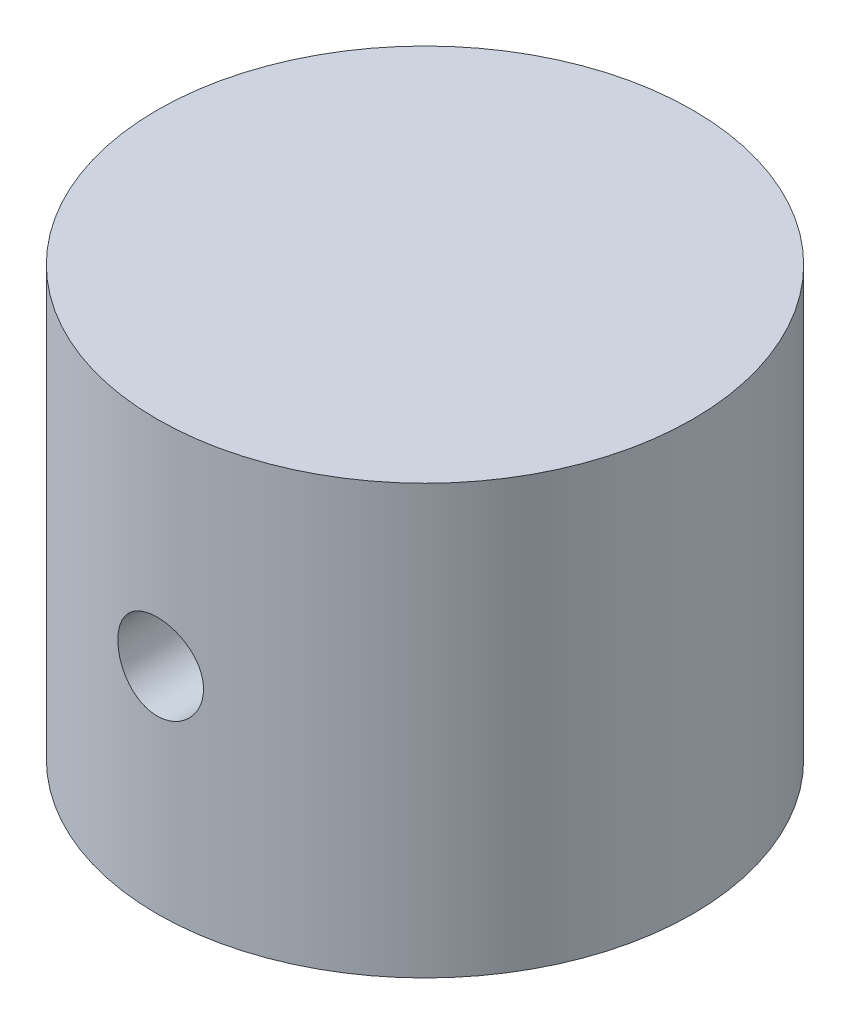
from build123d import *

# Parameters (mm, degrees)
CUT_EXTRUDE1_DEPTH      = 21.310096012
CUT_EXTRUDE1_DEPTH_BACK = 21.310096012
SKETCH2_R               = 2


with BuildPart() as part:
    # Sketch1 → Revolve1 (revolve)
    with BuildSketch(Plane.XY, mode=Mode.PRIVATE) as revolve1_sk:
        Polygon((6, -10), (12.5, -10), (12.5, 10), (0, 10), (0, 8), (6, 4.535898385), align=None)
    revolve(revolve1_sk.sketch.rotate(Axis((0, 10, 0), (0, -1, 0)), 180), axis=Axis((0, 10, 0), (0, -1, 0)))

    # Sketch2 → Cut-Extrude1 (cut, two sides: drawn at the far end of the back side and taken through both)
    with BuildSketch(Plane.XY.offset(-CUT_EXTRUDE1_DEPTH_BACK)):
        Circle(SKETCH2_R)
    extrude(amount=CUT_EXTRUDE1_DEPTH + CUT_EXTRUDE1_DEPTH_BACK, mode=Mode.SUBTRACT)


solid = part.part
